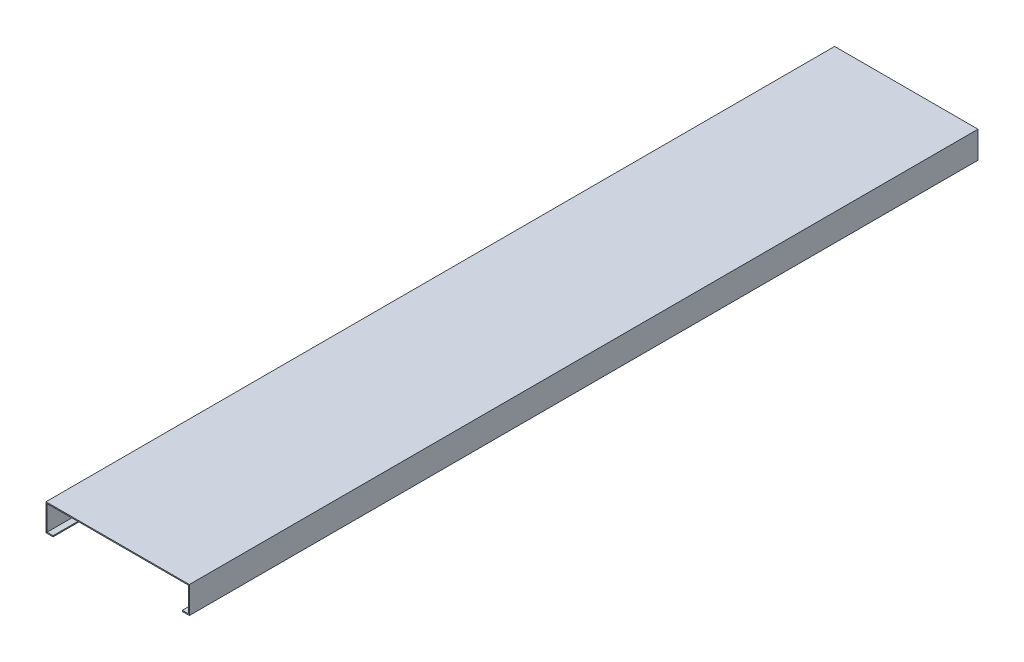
ISO-10303-21;
HEADER;
FILE_DESCRIPTION(('STEP AP214'),'2;1');
FILE_NAME('part.step','',(''),(''),'','','');
FILE_SCHEMA(('AUTOMOTIVE_DESIGN { 1 0 10303 214 1 1 1 1 }'));
ENDSEC;
DATA;
#1=APPLICATION_CONTEXT('core data for automotive mechanical design processes');
#2=APPLICATION_PROTOCOL_DEFINITION('international standard','automotive_design',2000,#1);
#3=PRODUCT_CONTEXT('',#1,'mechanical');
#4=PRODUCT('Part','Part','',(#3));
#5=PRODUCT_RELATED_PRODUCT_CATEGORY('part','',(#4));
#6=PRODUCT_DEFINITION_FORMATION('','',#4);
#7=PRODUCT_DEFINITION_CONTEXT('part definition',#1,'design');
#8=PRODUCT_DEFINITION('design','',#6,#7);
#9=PRODUCT_DEFINITION_SHAPE('','',#8);
#10=(LENGTH_UNIT() NAMED_UNIT(*) SI_UNIT(.MILLI.,.METRE.));
#11=(NAMED_UNIT(*) PLANE_ANGLE_UNIT() SI_UNIT($,.RADIAN.));
#12=(NAMED_UNIT(*) SI_UNIT($,.STERADIAN.) SOLID_ANGLE_UNIT());
#13=UNCERTAINTY_MEASURE_WITH_UNIT(LENGTH_MEASURE(1.E-05),#10,'distance_accuracy_value','');
#14=(GEOMETRIC_REPRESENTATION_CONTEXT(3) GLOBAL_UNCERTAINTY_ASSIGNED_CONTEXT((#13)) GLOBAL_UNIT_ASSIGNED_CONTEXT((#10,
#11,#12)) REPRESENTATION_CONTEXT('',''));
#15=CARTESIAN_POINT('',(0.,0.,0.));
#16=DIRECTION('',(0.,0.,1.));
#17=DIRECTION('',(1.,0.,0.));
#18=AXIS2_PLACEMENT_3D('',#15,#16,#17);
#19=CARTESIAN_POINT('',(0.,0.,1114.));
#20=DIRECTION('',(1.,0.,0.));
#21=DIRECTION('',(0.,1.,0.));
#22=AXIS2_PLACEMENT_3D('',#19,#20,#21);
#23=PLANE('',#22);
#24=DIRECTION('',(0.,-1.,0.));
#25=VECTOR('',#24,1.);
#26=CARTESIAN_POINT('',(0.,0.,0.));
#27=LINE('',#26,#25);
#28=CARTESIAN_POINT('',(0.,0.,0.));
#29=VERTEX_POINT('',#28);
#30=CARTESIAN_POINT('',(0.,-38.,0.));
#31=VERTEX_POINT('',#30);
#32=EDGE_CURVE('E151',#29,#31,#27,.T.);
#33=ORIENTED_EDGE('',*,*,#32,.T.);
#34=DIRECTION('',(0.,0.,-1.));
#35=VECTOR('',#34,1.);
#36=CARTESIAN_POINT('',(0.,-38.,1114.));
#37=LINE('',#36,#35);
#38=CARTESIAN_POINT('',(0.,-38.,1114.));
#39=VERTEX_POINT('',#38);
#40=EDGE_CURVE('E11',#39,#31,#37,.T.);
#41=ORIENTED_EDGE('',*,*,#40,.F.);
#42=DIRECTION('',(0.,-1.,0.));
#43=VECTOR('',#42,1.);
#44=CARTESIAN_POINT('',(0.,0.,1114.));
#45=LINE('',#44,#43);
#46=CARTESIAN_POINT('',(0.,0.,1114.));
#47=VERTEX_POINT('',#46);
#48=EDGE_CURVE('E173',#47,#39,#45,.T.);
#49=ORIENTED_EDGE('',*,*,#48,.F.);
#50=DIRECTION('',(0.,0.,-1.));
#51=VECTOR('',#50,1.);
#52=CARTESIAN_POINT('',(0.,0.,1114.));
#53=LINE('',#52,#51);
#54=EDGE_CURVE('E147',#47,#29,#53,.T.);
#55=ORIENTED_EDGE('',*,*,#54,.T.);
#56=EDGE_LOOP('',(#33,#41,#49,#55));
#57=FACE_BOUND('',#56,.T.);
#58=ADVANCED_FACE('F31',(#57),#23,.F.);
#59=CARTESIAN_POINT('',(0.,-38.,1114.));
#60=DIRECTION('',(0.,1.,0.));
#61=DIRECTION('',(0.,0.,1.));
#62=AXIS2_PLACEMENT_3D('',#59,#60,#61);
#63=PLANE('',#62);
#64=DIRECTION('',(1.,0.,0.));
#65=VECTOR('',#64,1.);
#66=CARTESIAN_POINT('',(0.,-38.,0.));
#67=LINE('',#66,#65);
#68=CARTESIAN_POINT('',(10.,-38.,0.));
#69=VERTEX_POINT('',#68);
#70=EDGE_CURVE('E154',#31,#69,#67,.T.);
#71=ORIENTED_EDGE('',*,*,#70,.T.);
#72=DIRECTION('',(0.,0.,-1.));
#73=VECTOR('',#72,1.);
#74=CARTESIAN_POINT('',(10.,-38.,1114.));
#75=LINE('',#74,#73);
#76=CARTESIAN_POINT('',(10.,-38.,1114.));
#77=VERTEX_POINT('',#76);
#78=EDGE_CURVE('E39',#77,#69,#75,.T.);
#79=ORIENTED_EDGE('',*,*,#78,.F.);
#80=DIRECTION('',(1.,0.,0.));
#81=VECTOR('',#80,1.);
#82=CARTESIAN_POINT('',(0.,-38.,1114.));
#83=LINE('',#82,#81);
#84=EDGE_CURVE('E102',#39,#77,#83,.T.);
#85=ORIENTED_EDGE('',*,*,#84,.F.);
#86=ORIENTED_EDGE('',*,*,#40,.T.);
#87=EDGE_LOOP('',(#71,#79,#85,#86));
#88=FACE_BOUND('',#87,.T.);
#89=ADVANCED_FACE('F251',(#88),#63,.F.);
#90=CARTESIAN_POINT('',(10.,-38.,1114.));
#91=DIRECTION('',(-1.,0.,0.));
#92=DIRECTION('',(0.,0.,1.));
#93=AXIS2_PLACEMENT_3D('',#90,#91,#92);
#94=PLANE('',#93);
#95=DIRECTION('',(0.,1.,0.));
#96=VECTOR('',#95,1.);
#97=CARTESIAN_POINT('',(10.,-38.,0.));
#98=LINE('',#97,#96);
#99=CARTESIAN_POINT('',(10.,-36.5,0.));
#100=VERTEX_POINT('',#99);
#101=EDGE_CURVE('E156',#69,#100,#98,.T.);
#102=ORIENTED_EDGE('',*,*,#101,.T.);
#103=DIRECTION('',(0.,0.,-1.));
#104=VECTOR('',#103,1.);
#105=CARTESIAN_POINT('',(10.,-36.5,1114.));
#106=LINE('',#105,#104);
#107=CARTESIAN_POINT('',(10.,-36.5,1114.));
#108=VERTEX_POINT('',#107);
#109=EDGE_CURVE('E192',#108,#100,#106,.T.);
#110=ORIENTED_EDGE('',*,*,#109,.F.);
#111=DIRECTION('',(0.,1.,0.));
#112=VECTOR('',#111,1.);
#113=CARTESIAN_POINT('',(10.,-38.,1114.));
#114=LINE('',#113,#112);
#115=EDGE_CURVE('E200',#77,#108,#114,.T.);
#116=ORIENTED_EDGE('',*,*,#115,.F.);
#117=ORIENTED_EDGE('',*,*,#78,.T.);
#118=EDGE_LOOP('',(#102,#110,#116,#117));
#119=FACE_BOUND('',#118,.T.);
#120=ADVANCED_FACE('F198',(#119),#94,.F.);
#121=CARTESIAN_POINT('',(10.,-36.5,1114.));
#122=DIRECTION('',(0.,-1.,0.));
#123=DIRECTION('',(1.,0.,0.));
#124=AXIS2_PLACEMENT_3D('',#121,#122,#123);
#125=PLANE('',#124);
#126=DIRECTION('',(-1.,0.,0.));
#127=VECTOR('',#126,1.);
#128=CARTESIAN_POINT('',(10.,-36.5,0.));
#129=LINE('',#128,#127);
#130=CARTESIAN_POINT('',(1.5,-36.5,0.));
#131=VERTEX_POINT('',#130);
#132=EDGE_CURVE('E158',#100,#131,#129,.T.);
#133=ORIENTED_EDGE('',*,*,#132,.T.);
#134=DIRECTION('',(0.,0.,-1.));
#135=VECTOR('',#134,1.);
#136=CARTESIAN_POINT('',(1.5,-36.5,1114.));
#137=LINE('',#136,#135);
#138=CARTESIAN_POINT('',(1.5,-36.5,1114.));
#139=VERTEX_POINT('',#138);
#140=EDGE_CURVE('E189',#139,#131,#137,.T.);
#141=ORIENTED_EDGE('',*,*,#140,.F.);
#142=DIRECTION('',(-1.,0.,0.));
#143=VECTOR('',#142,1.);
#144=CARTESIAN_POINT('',(10.,-36.5,1114.));
#145=LINE('',#144,#143);
#146=EDGE_CURVE('E218',#108,#139,#145,.T.);
#147=ORIENTED_EDGE('',*,*,#146,.F.);
#148=ORIENTED_EDGE('',*,*,#109,.T.);
#149=EDGE_LOOP('',(#133,#141,#147,#148));
#150=FACE_BOUND('',#149,.T.);
#151=ADVANCED_FACE('F209',(#150),#125,.F.);
#152=CARTESIAN_POINT('',(1.5,-36.5,1114.));
#153=DIRECTION('',(-1.,0.,0.));
#154=DIRECTION('',(0.,0.,1.));
#155=AXIS2_PLACEMENT_3D('',#152,#153,#154);
#156=PLANE('',#155);
#157=DIRECTION('',(0.,1.,0.));
#158=VECTOR('',#157,1.);
#159=CARTESIAN_POINT('',(1.5,-36.5,0.));
#160=LINE('',#159,#158);
#161=CARTESIAN_POINT('',(1.5,-1.50000000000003,0.));
#162=VERTEX_POINT('',#161);
#163=EDGE_CURVE('E160',#131,#162,#160,.T.);
#164=ORIENTED_EDGE('',*,*,#163,.T.);
#165=DIRECTION('',(0.,0.,-1.));
#166=VECTOR('',#165,1.);
#167=CARTESIAN_POINT('',(1.5,-1.50000000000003,1114.));
#168=LINE('',#167,#166);
#169=CARTESIAN_POINT('',(1.5,-1.50000000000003,1114.));
#170=VERTEX_POINT('',#169);
#171=EDGE_CURVE('E186',#170,#162,#168,.T.);
#172=ORIENTED_EDGE('',*,*,#171,.F.);
#173=DIRECTION('',(0.,1.,0.));
#174=VECTOR('',#173,1.);
#175=CARTESIAN_POINT('',(1.5,-36.5,1114.));
#176=LINE('',#175,#174);
#177=EDGE_CURVE('E215',#139,#170,#176,.T.);
#178=ORIENTED_EDGE('',*,*,#177,.F.);
#179=ORIENTED_EDGE('',*,*,#140,.T.);
#180=EDGE_LOOP('',(#164,#172,#178,#179));
#181=FACE_BOUND('',#180,.T.);
#182=ADVANCED_FACE('F213',(#181),#156,.F.);
#183=CARTESIAN_POINT('',(201.,-1.5,1114.));
#184=DIRECTION('',(0.,1.,0.));
#185=DIRECTION('',(-1.,0.,0.));
#186=AXIS2_PLACEMENT_3D('',#183,#184,#185);
#187=PLANE('',#186);
#188=DIRECTION('',(1.,0.,0.));
#189=VECTOR('',#188,1.);
#190=CARTESIAN_POINT('',(201.,-1.5,0.));
#191=LINE('',#190,#189);
#192=CARTESIAN_POINT('',(201.,-1.5,0.));
#193=VERTEX_POINT('',#192);
#194=EDGE_CURVE('E162',#162,#193,#191,.T.);
#195=ORIENTED_EDGE('',*,*,#194,.T.);
#196=DIRECTION('',(0.,0.,-1.));
#197=VECTOR('',#196,1.);
#198=CARTESIAN_POINT('',(201.,-1.5,1114.));
#199=LINE('',#198,#197);
#200=CARTESIAN_POINT('',(201.,-1.5,1114.));
#201=VERTEX_POINT('',#200);
#202=EDGE_CURVE('E183',#201,#193,#199,.T.);
#203=ORIENTED_EDGE('',*,*,#202,.F.);
#204=DIRECTION('',(1.,0.,0.));
#205=VECTOR('',#204,1.);
#206=CARTESIAN_POINT('',(201.,-1.5,1114.));
#207=LINE('',#206,#205);
#208=EDGE_CURVE('E217',#170,#201,#207,.T.);
#209=ORIENTED_EDGE('',*,*,#208,.F.);
#210=ORIENTED_EDGE('',*,*,#171,.T.);
#211=EDGE_LOOP('',(#195,#203,#209,#210));
#212=FACE_BOUND('',#211,.T.);
#213=ADVANCED_FACE('F264',(#212),#187,.F.);
#214=CARTESIAN_POINT('',(201.,-36.5,1114.));
#215=DIRECTION('',(1.,0.,0.));
#216=DIRECTION('',(0.,0.,-1.));
#217=AXIS2_PLACEMENT_3D('',#214,#215,#216);
#218=PLANE('',#217);
#219=DIRECTION('',(0.,-1.,0.));
#220=VECTOR('',#219,1.);
#221=CARTESIAN_POINT('',(201.,-36.5,0.));
#222=LINE('',#221,#220);
#223=CARTESIAN_POINT('',(201.,-36.5,0.));
#224=VERTEX_POINT('',#223);
#225=EDGE_CURVE('E164',#193,#224,#222,.T.);
#226=ORIENTED_EDGE('',*,*,#225,.T.);
#227=DIRECTION('',(0.,0.,-1.));
#228=VECTOR('',#227,1.);
#229=CARTESIAN_POINT('',(201.,-36.5,1114.));
#230=LINE('',#229,#228);
#231=CARTESIAN_POINT('',(201.,-36.5,1114.));
#232=VERTEX_POINT('',#231);
#233=EDGE_CURVE('E180',#232,#224,#230,.T.);
#234=ORIENTED_EDGE('',*,*,#233,.F.);
#235=DIRECTION('',(0.,-1.,0.));
#236=VECTOR('',#235,1.);
#237=CARTESIAN_POINT('',(201.,-36.5,1114.));
#238=LINE('',#237,#236);
#239=EDGE_CURVE('E220',#201,#232,#238,.T.);
#240=ORIENTED_EDGE('',*,*,#239,.F.);
#241=ORIENTED_EDGE('',*,*,#202,.T.);
#242=EDGE_LOOP('',(#226,#234,#240,#241));
#243=FACE_BOUND('',#242,.T.);
#244=ADVANCED_FACE('F267',(#243),#218,.F.);
#245=CARTESIAN_POINT('',(192.5,-36.5,1114.));
#246=DIRECTION('',(0.,-1.,0.));
#247=DIRECTION('',(0.,0.,-1.));
#248=AXIS2_PLACEMENT_3D('',#245,#246,#247);
#249=PLANE('',#248);
#250=DIRECTION('',(-1.,0.,0.));
#251=VECTOR('',#250,1.);
#252=CARTESIAN_POINT('',(192.5,-36.5,0.));
#253=LINE('',#252,#251);
#254=CARTESIAN_POINT('',(192.5,-36.5,0.));
#255=VERTEX_POINT('',#254);
#256=EDGE_CURVE('E166',#224,#255,#253,.T.);
#257=ORIENTED_EDGE('',*,*,#256,.T.);
#258=DIRECTION('',(0.,0.,-1.));
#259=VECTOR('',#258,1.);
#260=CARTESIAN_POINT('',(192.5,-36.5,1114.));
#261=LINE('',#260,#259);
#262=CARTESIAN_POINT('',(192.5,-36.5,1114.));
#263=VERTEX_POINT('',#262);
#264=EDGE_CURVE('E177',#263,#255,#261,.T.);
#265=ORIENTED_EDGE('',*,*,#264,.F.);
#266=DIRECTION('',(-1.,0.,0.));
#267=VECTOR('',#266,1.);
#268=CARTESIAN_POINT('',(192.5,-36.5,1114.));
#269=LINE('',#268,#267);
#270=EDGE_CURVE('E226',#232,#263,#269,.T.);
#271=ORIENTED_EDGE('',*,*,#270,.F.);
#272=ORIENTED_EDGE('',*,*,#233,.T.);
#273=EDGE_LOOP('',(#257,#265,#271,#272));
#274=FACE_BOUND('',#273,.T.);
#275=ADVANCED_FACE('F232',(#274),#249,.F.);
#276=CARTESIAN_POINT('',(192.5,-38.,1114.));
#277=DIRECTION('',(1.,0.,0.));
#278=DIRECTION('',(0.,0.,-1.));
#279=AXIS2_PLACEMENT_3D('',#276,#277,#278);
#280=PLANE('',#279);
#281=DIRECTION('',(0.,-1.,0.));
#282=VECTOR('',#281,1.);
#283=CARTESIAN_POINT('',(192.5,-38.,0.));
#284=LINE('',#283,#282);
#285=CARTESIAN_POINT('',(192.5,-38.,0.));
#286=VERTEX_POINT('',#285);
#287=EDGE_CURVE('E168',#255,#286,#284,.T.);
#288=ORIENTED_EDGE('',*,*,#287,.T.);
#289=DIRECTION('',(0.,0.,-1.));
#290=VECTOR('',#289,1.);
#291=CARTESIAN_POINT('',(192.5,-38.,1114.));
#292=LINE('',#291,#290);
#293=CARTESIAN_POINT('',(192.5,-38.,1114.));
#294=VERTEX_POINT('',#293);
#295=EDGE_CURVE('E142',#294,#286,#292,.T.);
#296=ORIENTED_EDGE('',*,*,#295,.F.);
#297=DIRECTION('',(0.,-1.,0.));
#298=VECTOR('',#297,1.);
#299=CARTESIAN_POINT('',(192.5,-38.,1114.));
#300=LINE('',#299,#298);
#301=EDGE_CURVE('E133',#263,#294,#300,.T.);
#302=ORIENTED_EDGE('',*,*,#301,.F.);
#303=ORIENTED_EDGE('',*,*,#264,.T.);
#304=EDGE_LOOP('',(#288,#296,#302,#303));
#305=FACE_BOUND('',#304,.T.);
#306=ADVANCED_FACE('F236',(#305),#280,.F.);
#307=CARTESIAN_POINT('',(202.5,-38.,1114.));
#308=DIRECTION('',(0.,1.,0.));
#309=DIRECTION('',(-1.,0.,0.));
#310=AXIS2_PLACEMENT_3D('',#307,#308,#309);
#311=PLANE('',#310);
#312=DIRECTION('',(1.,0.,0.));
#313=VECTOR('',#312,1.);
#314=CARTESIAN_POINT('',(202.5,-38.,0.));
#315=LINE('',#314,#313);
#316=CARTESIAN_POINT('',(202.5,-38.,0.));
#317=VERTEX_POINT('',#316);
#318=EDGE_CURVE('E141',#286,#317,#315,.T.);
#319=ORIENTED_EDGE('',*,*,#318,.T.);
#320=DIRECTION('',(0.,0.,-1.));
#321=VECTOR('',#320,1.);
#322=CARTESIAN_POINT('',(202.5,-38.,1114.));
#323=LINE('',#322,#321);
#324=CARTESIAN_POINT('',(202.5,-38.,1114.));
#325=VERTEX_POINT('',#324);
#326=EDGE_CURVE('E138',#325,#317,#323,.T.);
#327=ORIENTED_EDGE('',*,*,#326,.F.);
#328=DIRECTION('',(1.,0.,0.));
#329=VECTOR('',#328,1.);
#330=CARTESIAN_POINT('',(202.5,-38.,1114.));
#331=LINE('',#330,#329);
#332=EDGE_CURVE('E127',#294,#325,#331,.T.);
#333=ORIENTED_EDGE('',*,*,#332,.F.);
#334=ORIENTED_EDGE('',*,*,#295,.T.);
#335=EDGE_LOOP('',(#319,#327,#333,#334));
#336=FACE_BOUND('',#335,.T.);
#337=ADVANCED_FACE('F139',(#336),#311,.F.);
#338=CARTESIAN_POINT('',(202.5,0.,1114.));
#339=DIRECTION('',(-1.,0.,0.));
#340=DIRECTION('',(0.,0.,1.));
#341=AXIS2_PLACEMENT_3D('',#338,#339,#340);
#342=PLANE('',#341);
#343=DIRECTION('',(0.,1.,0.));
#344=VECTOR('',#343,1.);
#345=CARTESIAN_POINT('',(202.5,0.,0.));
#346=LINE('',#345,#344);
#347=CARTESIAN_POINT('',(202.5,0.,0.));
#348=VERTEX_POINT('',#347);
#349=EDGE_CURVE('E88',#317,#348,#346,.T.);
#350=ORIENTED_EDGE('',*,*,#349,.T.);
#351=DIRECTION('',(0.,0.,-1.));
#352=VECTOR('',#351,1.);
#353=CARTESIAN_POINT('',(202.5,0.,1114.));
#354=LINE('',#353,#352);
#355=CARTESIAN_POINT('',(202.5,0.,1114.));
#356=VERTEX_POINT('',#355);
#357=EDGE_CURVE('E143',#356,#348,#354,.T.);
#358=ORIENTED_EDGE('',*,*,#357,.F.);
#359=DIRECTION('',(0.,1.,0.));
#360=VECTOR('',#359,1.);
#361=CARTESIAN_POINT('',(202.5,0.,1114.));
#362=LINE('',#361,#360);
#363=EDGE_CURVE('E131',#325,#356,#362,.T.);
#364=ORIENTED_EDGE('',*,*,#363,.F.);
#365=ORIENTED_EDGE('',*,*,#326,.T.);
#366=EDGE_LOOP('',(#350,#358,#364,#365));
#367=FACE_BOUND('',#366,.T.);
#368=ADVANCED_FACE('F145',(#367),#342,.F.);
#369=CARTESIAN_POINT('',(0.,0.,1114.));
#370=DIRECTION('',(0.,-1.,0.));
#371=DIRECTION('',(0.,0.,-1.));
#372=AXIS2_PLACEMENT_3D('',#369,#370,#371);
#373=PLANE('',#372);
#374=DIRECTION('',(-1.,0.,0.));
#375=VECTOR('',#374,1.);
#376=CARTESIAN_POINT('',(0.,0.,0.));
#377=LINE('',#376,#375);
#378=EDGE_CURVE('E94',#348,#29,#377,.T.);
#379=ORIENTED_EDGE('',*,*,#378,.T.);
#380=ORIENTED_EDGE('',*,*,#54,.F.);
#381=DIRECTION('',(-1.,0.,0.));
#382=VECTOR('',#381,1.);
#383=CARTESIAN_POINT('',(0.,0.,1114.));
#384=LINE('',#383,#382);
#385=EDGE_CURVE('E47',#356,#47,#384,.T.);
#386=ORIENTED_EDGE('',*,*,#385,.F.);
#387=ORIENTED_EDGE('',*,*,#357,.T.);
#388=EDGE_LOOP('',(#379,#380,#386,#387));
#389=FACE_BOUND('',#388,.T.);
#390=ADVANCED_FACE('F240',(#389),#373,.F.);
#391=CARTESIAN_POINT('',(0.,-38.,1114.));
#392=DIRECTION('',(0.,0.,1.));
#393=DIRECTION('',(1.,0.,0.));
#394=AXIS2_PLACEMENT_3D('',#391,#392,#393);
#395=PLANE('',#394);
#396=ORIENTED_EDGE('',*,*,#48,.T.);
#397=ORIENTED_EDGE('',*,*,#84,.T.);
#398=ORIENTED_EDGE('',*,*,#115,.T.);
#399=ORIENTED_EDGE('',*,*,#146,.T.);
#400=ORIENTED_EDGE('',*,*,#177,.T.);
#401=ORIENTED_EDGE('',*,*,#208,.T.);
#402=ORIENTED_EDGE('',*,*,#239,.T.);
#403=ORIENTED_EDGE('',*,*,#270,.T.);
#404=ORIENTED_EDGE('',*,*,#301,.T.);
#405=ORIENTED_EDGE('',*,*,#332,.T.);
#406=ORIENTED_EDGE('',*,*,#363,.T.);
#407=ORIENTED_EDGE('',*,*,#385,.T.);
#408=EDGE_LOOP('',(#396,#397,#398,#399,#400,#401,#402,#403,#404,#405,#406,#407));
#409=FACE_BOUND('',#408,.T.);
#410=ADVANCED_FACE('F129',(#409),#395,.T.);
#411=CARTESIAN_POINT('',(0.,-38.,0.));
#412=DIRECTION('',(0.,0.,1.));
#413=DIRECTION('',(1.,0.,0.));
#414=AXIS2_PLACEMENT_3D('',#411,#412,#413);
#415=PLANE('',#414);
#416=ORIENTED_EDGE('',*,*,#32,.F.);
#417=ORIENTED_EDGE('',*,*,#378,.F.);
#418=ORIENTED_EDGE('',*,*,#349,.F.);
#419=ORIENTED_EDGE('',*,*,#318,.F.);
#420=ORIENTED_EDGE('',*,*,#287,.F.);
#421=ORIENTED_EDGE('',*,*,#256,.F.);
#422=ORIENTED_EDGE('',*,*,#225,.F.);
#423=ORIENTED_EDGE('',*,*,#194,.F.);
#424=ORIENTED_EDGE('',*,*,#163,.F.);
#425=ORIENTED_EDGE('',*,*,#132,.F.);
#426=ORIENTED_EDGE('',*,*,#101,.F.);
#427=ORIENTED_EDGE('',*,*,#70,.F.);
#428=EDGE_LOOP('',(#416,#417,#418,#419,#420,#421,#422,#423,#424,#425,#426,#427));
#429=FACE_BOUND('',#428,.T.);
#430=ADVANCED_FACE('F204',(#429),#415,.F.);
#431=CLOSED_SHELL('',(#58,#89,#120,#151,#182,#213,#244,#275,#306,#337,#368,#390,#410,#430));
#432=MANIFOLD_SOLID_BREP('B2',#431);
#433=ADVANCED_BREP_SHAPE_REPRESENTATION('',(#18,#432),#14);
#434=SHAPE_DEFINITION_REPRESENTATION(#9,#433);
ENDSEC;
END-ISO-10303-21;
